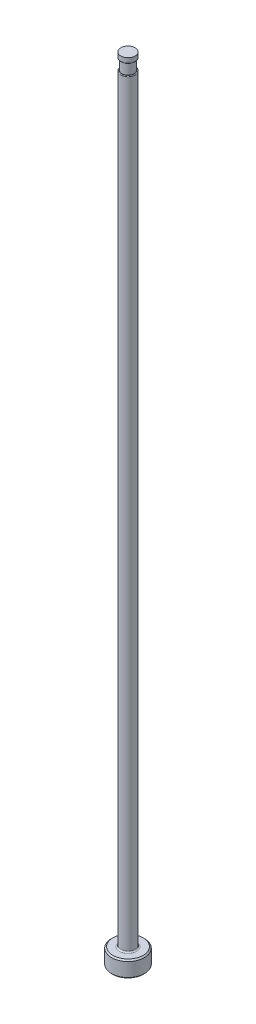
ISO-10303-21;
HEADER;
FILE_DESCRIPTION(('STEP AP214'),'2;1');
FILE_NAME('part.step','',(''),(''),'','','');
FILE_SCHEMA(('AUTOMOTIVE_DESIGN { 1 0 10303 214 1 1 1 1 }'));
ENDSEC;
DATA;
#1=APPLICATION_CONTEXT('core data for automotive mechanical design processes');
#2=APPLICATION_PROTOCOL_DEFINITION('international standard','automotive_design',2000,#1);
#3=PRODUCT_CONTEXT('',#1,'mechanical');
#4=PRODUCT('Part','Part','',(#3));
#5=PRODUCT_RELATED_PRODUCT_CATEGORY('part','',(#4));
#6=PRODUCT_DEFINITION_FORMATION('','',#4);
#7=PRODUCT_DEFINITION_CONTEXT('part definition',#1,'design');
#8=PRODUCT_DEFINITION('design','',#6,#7);
#9=PRODUCT_DEFINITION_SHAPE('','',#8);
#10=(LENGTH_UNIT() NAMED_UNIT(*) SI_UNIT(.MILLI.,.METRE.));
#11=(NAMED_UNIT(*) PLANE_ANGLE_UNIT() SI_UNIT($,.RADIAN.));
#12=(NAMED_UNIT(*) SI_UNIT($,.STERADIAN.) SOLID_ANGLE_UNIT());
#13=UNCERTAINTY_MEASURE_WITH_UNIT(LENGTH_MEASURE(1.E-05),#10,'distance_accuracy_value','');
#14=(GEOMETRIC_REPRESENTATION_CONTEXT(3) GLOBAL_UNCERTAINTY_ASSIGNED_CONTEXT((#13)) GLOBAL_UNIT_ASSIGNED_CONTEXT((#10,
#11,#12)) REPRESENTATION_CONTEXT('',''));
#15=CARTESIAN_POINT('',(0.,0.,0.));
#16=DIRECTION('',(0.,0.,1.));
#17=DIRECTION('',(1.,0.,0.));
#18=AXIS2_PLACEMENT_3D('',#15,#16,#17);
#19=CARTESIAN_POINT('',(-1.38810999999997,151.384,0.));
#20=DIRECTION('',(0.,1.,0.));
#21=DIRECTION('',(0.,0.,1.));
#22=AXIS2_PLACEMENT_3D('',#19,#20,#21);
#23=PLANE('',#22);
#24=CARTESIAN_POINT('',(0.,151.384,0.));
#25=DIRECTION('',(0.,1.,0.));
#26=DIRECTION('',(0.,0.,1.));
#27=AXIS2_PLACEMENT_3D('',#24,#25,#26);
#28=CIRCLE('',#27,1.25602999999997);
#29=CARTESIAN_POINT('',(0.,151.384,1.25602999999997));
#30=VERTEX_POINT('',#29);
#31=EDGE_CURVE('E11',#30,#30,#28,.F.);
#32=ORIENTED_EDGE('',*,*,#31,.T.);
#33=EDGE_LOOP('',(#32));
#34=FACE_BOUND('',#33,.T.);
#35=CARTESIAN_POINT('',(0.,151.384,0.));
#36=DIRECTION('',(0.,1.,0.));
#37=DIRECTION('',(0.,0.,1.));
#38=AXIS2_PLACEMENT_3D('',#35,#36,#37);
#39=CIRCLE('',#38,1.18490999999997);
#40=CARTESIAN_POINT('',(0.,151.384,1.18490999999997));
#41=VERTEX_POINT('',#40);
#42=EDGE_CURVE('E78',#41,#41,#39,.T.);
#43=ORIENTED_EDGE('',*,*,#42,.T.);
#44=EDGE_LOOP('',(#43));
#45=FACE_BOUND('',#44,.T.);
#46=ADVANCED_FACE('F36',(#34,#45),#23,.F.);
#47=CARTESIAN_POINT('',(0.,259.958771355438,0.));
#48=DIRECTION('',(0.,1.,0.));
#49=DIRECTION('',(0.,0.,1.));
#50=AXIS2_PLACEMENT_3D('',#47,#48,#49);
#51=CYLINDRICAL_SURFACE('',#50,1.38810999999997);
#52=DIRECTION('',(0.,1.,0.));
#53=VECTOR('',#52,1.);
#54=CARTESIAN_POINT('',(-1.18490999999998,259.958771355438,-0.723075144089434));
#55=LINE('',#54,#53);
#56=CARTESIAN_POINT('',(-1.18490999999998,149.225,-0.723075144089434));
#57=VERTEX_POINT('',#56);
#58=CARTESIAN_POINT('',(-1.18490999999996,86.868,-0.723075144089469));
#59=VERTEX_POINT('',#58);
#60=EDGE_CURVE('E73',#57,#59,#55,.F.);
#61=ORIENTED_EDGE('',*,*,#60,.F.);
#62=CARTESIAN_POINT('',(0.,149.225,0.));
#63=DIRECTION('',(0.,-1.,0.));
#64=DIRECTION('',(0.,0.,-1.));
#65=AXIS2_PLACEMENT_3D('',#62,#63,#64);
#66=CIRCLE('',#65,1.38810999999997);
#67=CARTESIAN_POINT('',(-1.18490999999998,149.225,0.723075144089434));
#68=VERTEX_POINT('',#67);
#69=EDGE_CURVE('E51',#57,#68,#66,.T.);
#70=ORIENTED_EDGE('',*,*,#69,.T.);
#71=DIRECTION('',(0.,1.,0.));
#72=VECTOR('',#71,1.);
#73=CARTESIAN_POINT('',(-1.18490999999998,259.958771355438,0.723075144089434));
#74=LINE('',#73,#72);
#75=CARTESIAN_POINT('',(-1.18490999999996,86.868,0.723075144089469));
#76=VERTEX_POINT('',#75);
#77=EDGE_CURVE('E84',#76,#68,#74,.T.);
#78=ORIENTED_EDGE('',*,*,#77,.F.);
#79=CARTESIAN_POINT('',(-1.18490999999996,86.868,-0.723075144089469));
#80=CARTESIAN_POINT('',(-1.18490489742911,86.8272205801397,-0.723062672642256));
#81=CARTESIAN_POINT('',(-1.18569554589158,86.7864368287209,-0.721787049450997));
#82=CARTESIAN_POINT('',(-1.18883387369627,86.7050484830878,-0.716617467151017));
#83=CARTESIAN_POINT('',(-1.1911833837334,86.6644441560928,-0.712720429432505));
#84=CARTESIAN_POINT('',(-1.19743938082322,86.5832508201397,-0.702157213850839));
#85=CARTESIAN_POINT('',(-1.20136288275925,86.5426669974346,-0.695460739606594));
#86=CARTESIAN_POINT('',(-1.21067765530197,86.4622938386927,-0.67911480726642));
#87=CARTESIAN_POINT('',(-1.2160681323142,86.4225040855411,-0.669466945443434));
#88=CARTESIAN_POINT('',(-1.23107456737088,86.3253821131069,-0.641613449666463));
#89=CARTESIAN_POINT('',(-1.24148150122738,86.2686925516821,-0.621519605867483));
#90=CARTESIAN_POINT('',(-1.26447851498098,86.1594679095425,-0.573286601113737));
#91=CARTESIAN_POINT('',(-1.27705975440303,86.1069172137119,-0.545179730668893));
#92=CARTESIAN_POINT('',(-1.299036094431,86.0236552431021,-0.48983438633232));
#93=CARTESIAN_POINT('',(-1.30819937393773,85.9912483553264,-0.465065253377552));
#94=CARTESIAN_POINT('',(-1.32626857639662,85.9306429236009,-0.410706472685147));
#95=CARTESIAN_POINT('',(-1.3351748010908,85.9024392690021,-0.381122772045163));
#96=CARTESIAN_POINT('',(-1.35001998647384,85.8572436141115,-0.323985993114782));
#97=CARTESIAN_POINT('',(-1.35618457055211,85.8391455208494,-0.297371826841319));
#98=CARTESIAN_POINT('',(-1.36726162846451,85.807356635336,-0.24136585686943));
#99=CARTESIAN_POINT('',(-1.37217474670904,85.793663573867,-0.211975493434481));
#100=CARTESIAN_POINT('',(-1.38024868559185,85.7714660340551,-0.150740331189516));
#101=CARTESIAN_POINT('',(-1.38339384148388,85.7630078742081,-0.118876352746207));
#102=CARTESIAN_POINT('',(-1.38743875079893,85.7521704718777,-0.0539942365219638));
#103=CARTESIAN_POINT('',(-1.38834050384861,85.7497858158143,-0.020977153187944));
#104=CARTESIAN_POINT('',(-1.38781595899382,85.7511829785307,0.0402827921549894));
#105=CARTESIAN_POINT('',(-1.38669623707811,85.7541526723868,0.0685504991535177));
#106=CARTESIAN_POINT('',(-1.38282885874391,85.7645312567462,0.124136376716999));
#107=CARTESIAN_POINT('',(-1.38008112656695,85.7719403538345,0.151454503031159));
#108=CARTESIAN_POINT('',(-1.37323772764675,85.790729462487,0.20440048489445));
#109=CARTESIAN_POINT('',(-1.36914590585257,85.8020981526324,0.23003291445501));
#110=CARTESIAN_POINT('',(-1.35995546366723,85.8282451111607,0.27928349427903));
#111=CARTESIAN_POINT('',(-1.35485642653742,85.8430247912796,0.302900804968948));
#112=CARTESIAN_POINT('',(-1.34133825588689,85.8833722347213,0.358961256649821));
#113=CARTESIAN_POINT('',(-1.33251649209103,85.9106776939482,0.390059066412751));
#114=CARTESIAN_POINT('',(-1.31441262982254,85.9699257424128,0.447296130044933));
#115=CARTESIAN_POINT('',(-1.3051296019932,86.001877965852,0.473424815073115));
#116=CARTESIAN_POINT('',(-1.28282911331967,86.0839694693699,0.531562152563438));
#117=CARTESIAN_POINT('',(-1.26997193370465,86.1359111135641,0.561075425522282));
#118=CARTESIAN_POINT('',(-1.24628723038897,86.2442374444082,0.611885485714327));
#119=CARTESIAN_POINT('',(-1.23546851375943,86.3006399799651,0.633147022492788));
#120=CARTESIAN_POINT('',(-1.2193975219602,86.3994407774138,0.663412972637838));
#121=CARTESIAN_POINT('',(-1.21343915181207,86.4412026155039,0.674183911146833));
#122=CARTESIAN_POINT('',(-1.20313242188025,86.5256684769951,0.692410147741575));
#123=CARTESIAN_POINT('',(-1.19878518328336,86.5683731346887,0.69986313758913));
#124=CARTESIAN_POINT('',(-1.19185743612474,86.6538039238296,0.711598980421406));
#125=CARTESIAN_POINT('',(-1.18925556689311,86.6965231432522,0.715920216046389));
#126=CARTESIAN_POINT('',(-1.18577996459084,86.7821637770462,0.721648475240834));
#127=CARTESIAN_POINT('',(-1.18490366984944,86.8250847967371,0.723059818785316));
#128=CARTESIAN_POINT('',(-1.18490999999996,86.868,0.723075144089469));
#129=B_SPLINE_CURVE_WITH_KNOTS('',3,(#79,#80,#81,#82,#83,#84,#85,#86,#87,#88,#89,#90,#91,#92,
#93,#94,#95,#96,#97,#98,#99,#100,#101,#102,#103,#104,#105,#106,#107,#108,#109,#110,#111,#112,
#113,#114,#115,#116,#117,#118,#119,#120,#121,#122,#123,#124,#125,#126,#127,#128),.UNSPECIFIED.,
.F.,.F.,(4,2,2,2,2,2,2,2,2,2,2,2,2,2,2,2,2,2,2,2,2,2,2,2,4),(0.,0.122317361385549,
0.244778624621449,0.368600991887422,0.492356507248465,0.674882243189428,0.856682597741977,
0.981714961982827,1.10659403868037,1.20453097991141,1.30241738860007,1.40115795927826,
1.49981048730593,1.58473133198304,1.66965612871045,1.75434007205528,1.83905912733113,
1.96528739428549,2.09178120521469,2.27410969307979,2.45720871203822,2.58766049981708,
2.71820289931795,2.8471169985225,2.97583957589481),.UNSPECIFIED.);
#130=EDGE_CURVE('E81',#59,#76,#129,.T.);
#131=ORIENTED_EDGE('',*,*,#130,.F.);
#132=EDGE_LOOP('',(#61,#70,#78,#131));
#133=FACE_BOUND('',#132,.T.);
#134=CARTESIAN_POINT('',(0.,3.42900000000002,0.));
#135=DIRECTION('',(0.,1.,0.));
#136=DIRECTION('',(0.,0.,1.));
#137=AXIS2_PLACEMENT_3D('',#134,#135,#136);
#138=CIRCLE('',#137,1.38810999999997);
#139=CARTESIAN_POINT('',(0.,3.42900000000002,1.38810999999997));
#140=VERTEX_POINT('',#139);
#141=EDGE_CURVE('E116',#140,#140,#138,.T.);
#142=ORIENTED_EDGE('',*,*,#141,.T.);
#143=EDGE_LOOP('',(#142));
#144=FACE_BOUND('',#143,.T.);
#145=ADVANCED_FACE('F82',(#133,#144),#51,.T.);
#146=CARTESIAN_POINT('',(0.,0.,0.));
#147=DIRECTION('',(0.,-1.,0.));
#148=DIRECTION('',(0.,0.,-1.));
#149=AXIS2_PLACEMENT_3D('',#146,#147,#148);
#150=PLANE('',#149);
#151=CARTESIAN_POINT('',(0.,0.,0.));
#152=DIRECTION('',(0.,-1.,0.));
#153=DIRECTION('',(0.,0.,-1.));
#154=AXIS2_PLACEMENT_3D('',#151,#152,#153);
#155=CIRCLE('',#154,2.92099999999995);
#156=CARTESIAN_POINT('',(0.,0.,-2.92099999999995));
#157=VERTEX_POINT('',#156);
#158=EDGE_CURVE('E113',#157,#157,#155,.T.);
#159=ORIENTED_EDGE('',*,*,#158,.T.);
#160=EDGE_LOOP('',(#159));
#161=FACE_BOUND('',#160,.T.);
#162=ADVANCED_FACE('F192',(#161),#150,.T.);
#163=CARTESIAN_POINT('',(0.,259.958771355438,0.));
#164=DIRECTION('',(0.,1.,0.));
#165=DIRECTION('',(0.,0.,1.));
#166=AXIS2_PLACEMENT_3D('',#163,#164,#165);
#167=CYLINDRICAL_SURFACE('',#166,3.17499999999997);
#168=CARTESIAN_POINT('',(0.,2.92100000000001,0.));
#169=DIRECTION('',(0.,1.,0.));
#170=DIRECTION('',(0.,0.,1.));
#171=AXIS2_PLACEMENT_3D('',#168,#169,#170);
#172=CIRCLE('',#171,3.17499999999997);
#173=CARTESIAN_POINT('',(0.,2.92100000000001,3.17499999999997));
#174=VERTEX_POINT('',#173);
#175=EDGE_CURVE('E110',#174,#174,#172,.F.);
#176=ORIENTED_EDGE('',*,*,#175,.T.);
#177=EDGE_LOOP('',(#176));
#178=FACE_BOUND('',#177,.T.);
#179=CARTESIAN_POINT('',(0.,0.254000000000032,0.));
#180=DIRECTION('',(0.,-1.,0.));
#181=DIRECTION('',(0.,0.,-1.));
#182=AXIS2_PLACEMENT_3D('',#179,#180,#181);
#183=CIRCLE('',#182,3.17499999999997);
#184=CARTESIAN_POINT('',(0.,0.254000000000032,-3.17499999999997));
#185=VERTEX_POINT('',#184);
#186=EDGE_CURVE('E107',#185,#185,#183,.F.);
#187=ORIENTED_EDGE('',*,*,#186,.T.);
#188=EDGE_LOOP('',(#187));
#189=FACE_BOUND('',#188,.T.);
#190=ADVANCED_FACE('F195',(#178,#189),#167,.T.);
#191=CARTESIAN_POINT('',(-3.17499999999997,3.175,0.));
#192=DIRECTION('',(0.,1.,0.));
#193=DIRECTION('',(0.,0.,1.));
#194=AXIS2_PLACEMENT_3D('',#191,#192,#193);
#195=PLANE('',#194);
#196=CARTESIAN_POINT('',(0.,3.175,0.));
#197=DIRECTION('',(0.,1.,0.));
#198=DIRECTION('',(0.,0.,1.));
#199=AXIS2_PLACEMENT_3D('',#196,#197,#198);
#200=CIRCLE('',#199,1.64210999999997);
#201=CARTESIAN_POINT('',(0.,3.175,1.64210999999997));
#202=VERTEX_POINT('',#201);
#203=EDGE_CURVE('E87',#202,#202,#200,.F.);
#204=ORIENTED_EDGE('',*,*,#203,.T.);
#205=EDGE_LOOP('',(#204));
#206=FACE_BOUND('',#205,.T.);
#207=CARTESIAN_POINT('',(0.,3.175,0.));
#208=DIRECTION('',(0.,1.,0.));
#209=DIRECTION('',(0.,0.,1.));
#210=AXIS2_PLACEMENT_3D('',#207,#208,#209);
#211=CIRCLE('',#210,2.92099999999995);
#212=CARTESIAN_POINT('',(0.,3.175,2.92099999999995));
#213=VERTEX_POINT('',#212);
#214=EDGE_CURVE('E104',#213,#213,#211,.T.);
#215=ORIENTED_EDGE('',*,*,#214,.T.);
#216=EDGE_LOOP('',(#215));
#217=FACE_BOUND('',#216,.T.);
#218=ADVANCED_FACE('F190',(#206,#217),#195,.T.);
#219=CARTESIAN_POINT('',(0.,3.17499999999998,0.));
#220=DIRECTION('',(0.,-1.,0.));
#221=DIRECTION('',(0.,0.,-1.));
#222=AXIS2_PLACEMENT_3D('',#219,#220,#221);
#223=CONICAL_SURFACE('',#222,2.92099999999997,0.7853981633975);
#224=ORIENTED_EDGE('',*,*,#175,.F.);
#225=EDGE_LOOP('',(#224));
#226=FACE_BOUND('',#225,.T.);
#227=ORIENTED_EDGE('',*,*,#214,.F.);
#228=EDGE_LOOP('',(#227));
#229=FACE_BOUND('',#228,.T.);
#230=ADVANCED_FACE('F186',(#226,#229),#223,.T.);
#231=CARTESIAN_POINT('',(0.,0.254000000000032,0.));
#232=DIRECTION('',(0.,1.,0.));
#233=DIRECTION('',(0.,0.,1.));
#234=AXIS2_PLACEMENT_3D('',#231,#232,#233);
#235=CONICAL_SURFACE('',#234,3.17499999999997,0.785398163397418);
#236=ORIENTED_EDGE('',*,*,#158,.F.);
#237=EDGE_LOOP('',(#236));
#238=FACE_BOUND('',#237,.T.);
#239=ORIENTED_EDGE('',*,*,#186,.F.);
#240=EDGE_LOOP('',(#239));
#241=FACE_BOUND('',#240,.T.);
#242=ADVANCED_FACE('F182',(#238,#241),#235,.T.);
#243=CARTESIAN_POINT('',(0.,3.42900000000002,0.));
#244=DIRECTION('',(0.,1.,0.));
#245=DIRECTION('',(0.,0.,1.));
#246=AXIS2_PLACEMENT_3D('',#243,#244,#245);
#247=TOROIDAL_SURFACE('',#246,1.64210999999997,0.254);
#248=ORIENTED_EDGE('',*,*,#203,.F.);
#249=EDGE_LOOP('',(#248));
#250=FACE_BOUND('',#249,.T.);
#251=ORIENTED_EDGE('',*,*,#141,.F.);
#252=EDGE_LOOP('',(#251));
#253=FACE_BOUND('',#252,.T.);
#254=ADVANCED_FACE('F147',(#250,#253),#247,.F.);
#255=CARTESIAN_POINT('',(-1.38810999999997,149.352,0.));
#256=DIRECTION('',(0.,-1.,0.));
#257=DIRECTION('',(0.,0.,-1.));
#258=AXIS2_PLACEMENT_3D('',#255,#256,#257);
#259=PLANE('',#258);
#260=DIRECTION('',(0.,0.,1.));
#261=VECTOR('',#260,1.);
#262=CARTESIAN_POINT('',(-1.18490999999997,149.352,0.));
#263=LINE('',#262,#261);
#264=CARTESIAN_POINT('',(-1.18490999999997,149.352,0.));
#265=VERTEX_POINT('',#264);
#266=CARTESIAN_POINT('',(-1.18490999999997,149.352,0.431725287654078));
#267=VERTEX_POINT('',#266);
#268=EDGE_CURVE('E90',#265,#267,#263,.T.);
#269=ORIENTED_EDGE('',*,*,#268,.T.);
#270=CARTESIAN_POINT('',(0.,149.352,0.));
#271=DIRECTION('',(0.,-1.,0.));
#272=DIRECTION('',(0.,0.,-1.));
#273=AXIS2_PLACEMENT_3D('',#270,#271,#272);
#274=CIRCLE('',#273,1.26110999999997);
#275=CARTESIAN_POINT('',(-1.18490999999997,149.352,-0.431725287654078));
#276=VERTEX_POINT('',#275);
#277=EDGE_CURVE('E86',#267,#276,#274,.F.);
#278=ORIENTED_EDGE('',*,*,#277,.T.);
#279=EDGE_CURVE('E79',#276,#265,#263,.T.);
#280=ORIENTED_EDGE('',*,*,#279,.T.);
#281=CARTESIAN_POINT('',(0.,149.352,0.));
#282=DIRECTION('',(0.,1.,0.));
#283=DIRECTION('',(0.,0.,1.));
#284=AXIS2_PLACEMENT_3D('',#281,#282,#283);
#285=CIRCLE('',#284,1.18490999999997);
#286=EDGE_CURVE('E101',#265,#265,#285,.T.);
#287=ORIENTED_EDGE('',*,*,#286,.F.);
#288=EDGE_LOOP('',(#269,#278,#280,#287));
#289=FACE_BOUND('',#288,.T.);
#290=ADVANCED_FACE('F144',(#289),#259,.F.);
#291=CARTESIAN_POINT('',(0.,153.448281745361,0.));
#292=DIRECTION('',(0.,1.,0.));
#293=DIRECTION('',(0.,0.,1.));
#294=AXIS2_PLACEMENT_3D('',#291,#292,#293);
#295=CYLINDRICAL_SURFACE('',#294,1.18490999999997);
#296=ORIENTED_EDGE('',*,*,#42,.F.);
#297=EDGE_LOOP('',(#296));
#298=FACE_BOUND('',#297,.T.);
#299=ORIENTED_EDGE('',*,*,#286,.T.);
#300=EDGE_LOOP('',(#299));
#301=FACE_BOUND('',#300,.T.);
#302=ADVANCED_FACE('F141',(#298,#301),#295,.T.);
#303=CARTESIAN_POINT('',(-1.18490999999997,150.368,-3.17499999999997));
#304=DIRECTION('',(1.,0.,0.));
#305=DIRECTION('',(0.,1.,0.));
#306=AXIS2_PLACEMENT_3D('',#303,#304,#305);
#307=PLANE('',#306);
#308=ORIENTED_EDGE('',*,*,#279,.F.);
#309=CARTESIAN_POINT('',(-1.18490999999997,149.352,-0.431725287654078));
#310=CARTESIAN_POINT('',(-1.18490999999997,149.351996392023,-0.443927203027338));
#311=CARTESIAN_POINT('',(-1.18490999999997,149.351793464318,-0.456134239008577));
#312=CARTESIAN_POINT('',(-1.18490999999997,149.350871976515,-0.480559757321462));
#313=CARTESIAN_POINT('',(-1.18490999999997,149.350152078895,-0.492778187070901));
#314=CARTESIAN_POINT('',(-1.18490999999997,149.348068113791,-0.51728578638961));
#315=CARTESIAN_POINT('',(-1.18490999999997,149.346697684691,-0.529574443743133));
#316=CARTESIAN_POINT('',(-1.18490999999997,149.343154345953,-0.554026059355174));
#317=CARTESIAN_POINT('',(-1.18490999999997,149.340982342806,-0.566189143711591));
#318=CARTESIAN_POINT('',(-1.18490999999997,149.33585310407,-0.589290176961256));
#319=CARTESIAN_POINT('',(-1.18490999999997,149.332976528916,-0.600245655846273));
#320=CARTESIAN_POINT('',(-1.18490999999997,149.326158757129,-0.621829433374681));
#321=CARTESIAN_POINT('',(-1.18490999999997,149.32221796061,-0.632457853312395));
#322=CARTESIAN_POINT('',(-1.18490999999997,149.313651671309,-0.651596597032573));
#323=CARTESIAN_POINT('',(-1.18490999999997,149.309211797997,-0.660188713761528));
#324=CARTESIAN_POINT('',(-1.18490999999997,149.299086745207,-0.676609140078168));
#325=CARTESIAN_POINT('',(-1.18490999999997,149.293405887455,-0.684439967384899));
#326=CARTESIAN_POINT('',(-1.18490999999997,149.283548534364,-0.695366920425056));
#327=CARTESIAN_POINT('',(-1.18490999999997,149.279921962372,-0.698957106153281));
#328=CARTESIAN_POINT('',(-1.18490999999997,149.272202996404,-0.705604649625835));
#329=CARTESIAN_POINT('',(-1.18490999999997,149.268110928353,-0.708662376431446));
#330=CARTESIAN_POINT('',(-1.18490999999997,149.260145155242,-0.71362633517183));
#331=CARTESIAN_POINT('',(-1.18490999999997,149.256337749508,-0.715637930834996));
#332=CARTESIAN_POINT('',(-1.18490999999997,149.248445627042,-0.719002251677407));
#333=CARTESIAN_POINT('',(-1.18490999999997,149.244361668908,-0.720356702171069));
#334=CARTESIAN_POINT('',(-1.18490999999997,149.237704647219,-0.721899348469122));
#335=CARTESIAN_POINT('',(-1.18490999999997,149.23518800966,-0.722337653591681));
#336=CARTESIAN_POINT('',(-1.18490999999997,149.230115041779,-0.722926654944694));
#337=CARTESIAN_POINT('',(-1.18490999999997,149.22755862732,-0.723076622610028));
#338=CARTESIAN_POINT('',(-1.18490999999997,149.225000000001,-0.723075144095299));
#339=B_SPLINE_CURVE_WITH_KNOTS('',3,(#309,#310,#311,#312,#313,#314,#315,#316,#317,#318,#319,
#320,#321,#322,#323,#324,#325,#326,#327,#328,#329,#330,#331,#332,#333,#334,#335,#336,#337,#338),
.UNSPECIFIED.,.F.,.F.,(4,2,2,2,2,2,2,2,2,2,2,2,2,2,4),(0.,0.0366119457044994,0.0733189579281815,
0.110392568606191,0.14742438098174,0.181365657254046,0.215294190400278,0.244238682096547,
0.273083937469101,0.288356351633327,0.303618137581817,0.316487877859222,0.329323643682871,
0.336971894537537,0.34463944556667),.UNSPECIFIED.);
#340=EDGE_CURVE('E59',#276,#57,#339,.T.);
#341=ORIENTED_EDGE('',*,*,#340,.T.);
#342=ORIENTED_EDGE('',*,*,#60,.T.);
#343=DIRECTION('',(0.,0.,1.));
#344=VECTOR('',#343,1.);
#345=CARTESIAN_POINT('',(-1.18490999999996,86.868,-3.17499999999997));
#346=LINE('',#345,#344);
#347=EDGE_CURVE('E77',#59,#76,#346,.T.);
#348=ORIENTED_EDGE('',*,*,#347,.T.);
#349=ORIENTED_EDGE('',*,*,#77,.T.);
#350=CARTESIAN_POINT('',(-1.18490999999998,149.225,0.723075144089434));
#351=CARTESIAN_POINT('',(-1.18490999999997,149.228961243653,0.723084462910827));
#352=CARTESIAN_POINT('',(-1.18490999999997,149.232912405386,0.72271992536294));
#353=CARTESIAN_POINT('',(-1.18490999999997,149.240661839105,0.721324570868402));
#354=CARTESIAN_POINT('',(-1.18490999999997,149.244461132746,0.720299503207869));
#355=CARTESIAN_POINT('',(-1.18490999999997,149.251834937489,0.717665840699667));
#356=CARTESIAN_POINT('',(-1.18490999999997,149.255410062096,0.716058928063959));
#357=CARTESIAN_POINT('',(-1.18490999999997,149.262307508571,0.712363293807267));
#358=CARTESIAN_POINT('',(-1.18490999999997,149.265629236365,0.710273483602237));
#359=CARTESIAN_POINT('',(-1.18490999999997,149.274123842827,0.704186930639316));
#360=CARTESIAN_POINT('',(-1.18490999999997,149.279051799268,0.699848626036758));
#361=CARTESIAN_POINT('',(-1.18490999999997,149.288179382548,0.69046605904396));
#362=CARTESIAN_POINT('',(-1.18490999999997,149.292376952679,0.685419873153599));
#363=CARTESIAN_POINT('',(-1.18490999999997,149.302925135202,0.671062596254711));
#364=CARTESIAN_POINT('',(-1.18490999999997,149.30865072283,0.661296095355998));
#365=CARTESIAN_POINT('',(-1.18490999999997,149.31864686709,0.641058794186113));
#366=CARTESIAN_POINT('',(-1.18490999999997,149.322913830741,0.630586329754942));
#367=CARTESIAN_POINT('',(-1.18490999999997,149.334249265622,0.597997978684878));
#368=CARTESIAN_POINT('',(-1.18490999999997,149.339516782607,0.575266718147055));
#369=CARTESIAN_POINT('',(-1.18490999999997,149.347081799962,0.529347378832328));
#370=CARTESIAN_POINT('',(-1.18490999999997,149.349370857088,0.50615818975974));
#371=CARTESIAN_POINT('',(-1.18490999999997,149.351127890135,0.474376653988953));
#372=CARTESIAN_POINT('',(-1.18490999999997,149.351464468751,0.465824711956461));
#373=CARTESIAN_POINT('',(-1.18490999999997,149.351899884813,0.448756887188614));
#374=CARTESIAN_POINT('',(-1.18490999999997,149.351999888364,0.440241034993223));
#375=CARTESIAN_POINT('',(-1.18490999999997,149.352,0.431725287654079));
#376=B_SPLINE_CURVE_WITH_KNOTS('',3,(#350,#351,#352,#353,#354,#355,#356,#357,#358,#359,#360,
#361,#362,#363,#364,#365,#366,#367,#368,#369,#370,#371,#372,#373,#374,#375),.UNSPECIFIED.,.F.,
.F.,(4,2,2,2,2,2,2,2,2,2,2,2,4),(0.,0.0118509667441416,0.0236001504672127,0.0353156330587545,
0.0470577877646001,0.0666403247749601,0.0862771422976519,0.120048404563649,0.153902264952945,
0.223511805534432,0.293318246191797,0.31899141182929,0.344537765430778),.UNSPECIFIED.);
#377=EDGE_CURVE('E172',#68,#267,#376,.T.);
#378=ORIENTED_EDGE('',*,*,#377,.T.);
#379=ORIENTED_EDGE('',*,*,#268,.F.);
#380=EDGE_LOOP('',(#308,#341,#342,#348,#349,#378,#379));
#381=FACE_BOUND('',#380,.T.);
#382=ADVANCED_FACE('F75',(#381),#307,.F.);
#383=CARTESIAN_POINT('',(-4.35990999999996,86.868,-3.17499999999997));
#384=DIRECTION('',(0.,0.,1.));
#385=DIRECTION('',(1.,0.,0.));
#386=AXIS2_PLACEMENT_3D('',#383,#384,#385);
#387=CYLINDRICAL_SURFACE('',#386,3.175);
#388=ORIENTED_EDGE('',*,*,#347,.F.);
#389=ORIENTED_EDGE('',*,*,#130,.T.);
#390=EDGE_LOOP('',(#388,#389));
#391=FACE_BOUND('',#390,.T.);
#392=ADVANCED_FACE('F89',(#391),#387,.F.);
#393=CARTESIAN_POINT('',(0.,152.687735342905,0.));
#394=DIRECTION('',(0.,1.,0.));
#395=DIRECTION('',(0.,0.,1.));
#396=AXIS2_PLACEMENT_3D('',#393,#394,#395);
#397=CYLINDRICAL_SURFACE('',#396,1.38302999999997);
#398=CARTESIAN_POINT('',(0.,151.511,0.));
#399=DIRECTION('',(0.,1.,0.));
#400=DIRECTION('',(0.,0.,1.));
#401=AXIS2_PLACEMENT_3D('',#398,#399,#400);
#402=CIRCLE('',#401,1.38302999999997);
#403=CARTESIAN_POINT('',(0.,151.511,1.38302999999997));
#404=VERTEX_POINT('',#403);
#405=EDGE_CURVE('E44',#404,#404,#402,.T.);
#406=ORIENTED_EDGE('',*,*,#405,.T.);
#407=EDGE_LOOP('',(#406));
#408=FACE_BOUND('',#407,.T.);
#409=CARTESIAN_POINT('',(0.,152.4,0.));
#410=DIRECTION('',(0.,1.,0.));
#411=DIRECTION('',(0.,0.,1.));
#412=AXIS2_PLACEMENT_3D('',#409,#410,#411);
#413=CIRCLE('',#412,1.38302999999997);
#414=CARTESIAN_POINT('',(0.,152.4,1.38302999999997));
#415=VERTEX_POINT('',#414);
#416=EDGE_CURVE('E91',#415,#415,#413,.T.);
#417=ORIENTED_EDGE('',*,*,#416,.F.);
#418=EDGE_LOOP('',(#417));
#419=FACE_BOUND('',#418,.T.);
#420=ADVANCED_FACE('F135',(#408,#419),#397,.T.);
#421=CARTESIAN_POINT('',(-1.38810999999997,152.4,0.));
#422=DIRECTION('',(0.,1.,0.));
#423=DIRECTION('',(0.,0.,1.));
#424=AXIS2_PLACEMENT_3D('',#421,#422,#423);
#425=PLANE('',#424);
#426=ORIENTED_EDGE('',*,*,#416,.T.);
#427=EDGE_LOOP('',(#426));
#428=FACE_BOUND('',#427,.T.);
#429=ADVANCED_FACE('F149',(#428),#425,.T.);
#430=CARTESIAN_POINT('',(0.,149.225,0.));
#431=DIRECTION('',(0.,-1.,0.));
#432=DIRECTION('',(0.,0.,-1.));
#433=AXIS2_PLACEMENT_3D('',#430,#431,#432);
#434=TOROIDAL_SURFACE('',#433,1.26110999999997,0.127);
#435=ORIENTED_EDGE('',*,*,#377,.F.);
#436=ORIENTED_EDGE('',*,*,#69,.F.);
#437=ORIENTED_EDGE('',*,*,#340,.F.);
#438=ORIENTED_EDGE('',*,*,#277,.F.);
#439=EDGE_LOOP('',(#435,#436,#437,#438));
#440=FACE_BOUND('',#439,.T.);
#441=ADVANCED_FACE('F151',(#440),#434,.T.);
#442=CARTESIAN_POINT('',(0.,151.511,0.));
#443=DIRECTION('',(0.,1.,0.));
#444=DIRECTION('',(0.,0.,1.));
#445=AXIS2_PLACEMENT_3D('',#442,#443,#444);
#446=TOROIDAL_SURFACE('',#445,1.25602999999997,0.127);
#447=ORIENTED_EDGE('',*,*,#31,.F.);
#448=EDGE_LOOP('',(#447));
#449=FACE_BOUND('',#448,.T.);
#450=ORIENTED_EDGE('',*,*,#405,.F.);
#451=EDGE_LOOP('',(#450));
#452=FACE_BOUND('',#451,.T.);
#453=ADVANCED_FACE('F38',(#449,#452),#446,.T.);
#454=CLOSED_SHELL('',(#46,#145,#162,#190,#218,#230,#242,#254,#290,#302,#382,#392,#420,#429,#441,#453));
#455=MANIFOLD_SOLID_BREP('B2',#454);
#456=ADVANCED_BREP_SHAPE_REPRESENTATION('',(#18,#455),#14);
#457=SHAPE_DEFINITION_REPRESENTATION(#9,#456);
ENDSEC;
END-ISO-10303-21;
